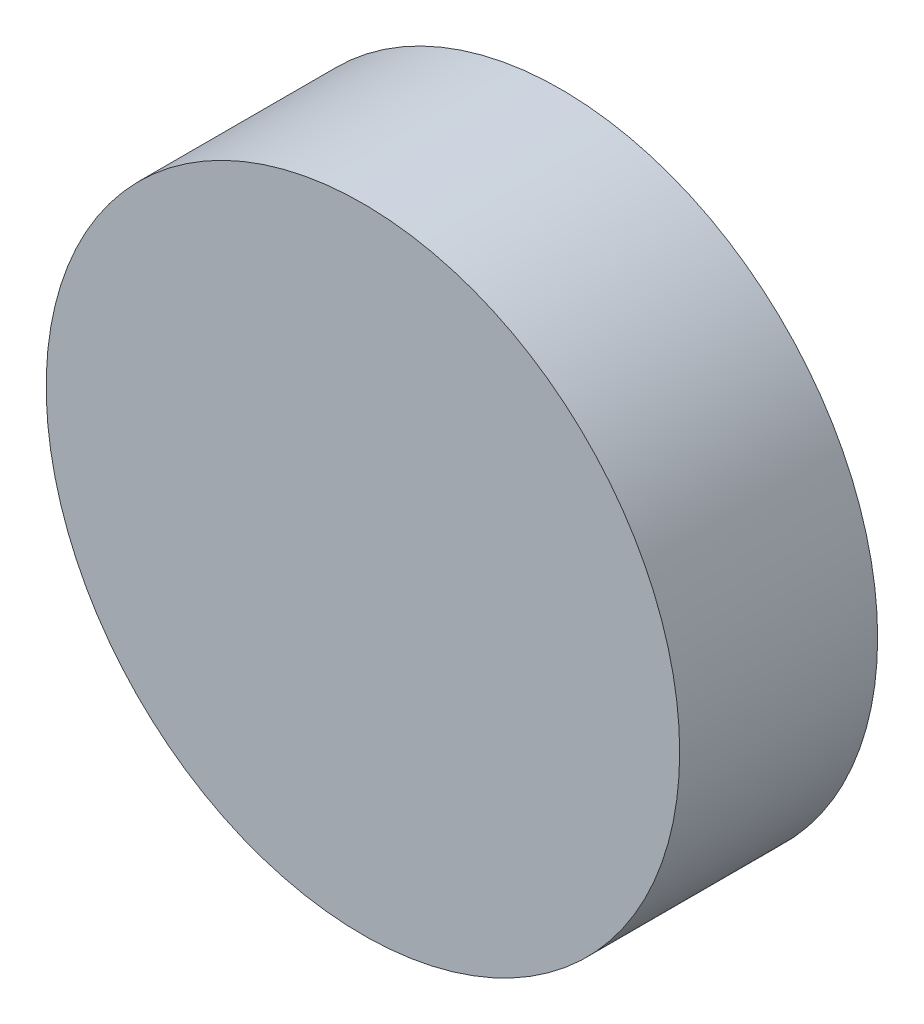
from build123d import *

# Parameters (mm, degrees)
SKETCH1_R           = 80
BOSS_EXTRUDE1_DEPTH = 50


with BuildPart() as part:
    # Sketch1 → Boss-Extrude1 (new body)
    with BuildSketch(Plane.XY):
        Circle(SKETCH1_R)
    extrude(amount=BOSS_EXTRUDE1_DEPTH)


solid = part.part
